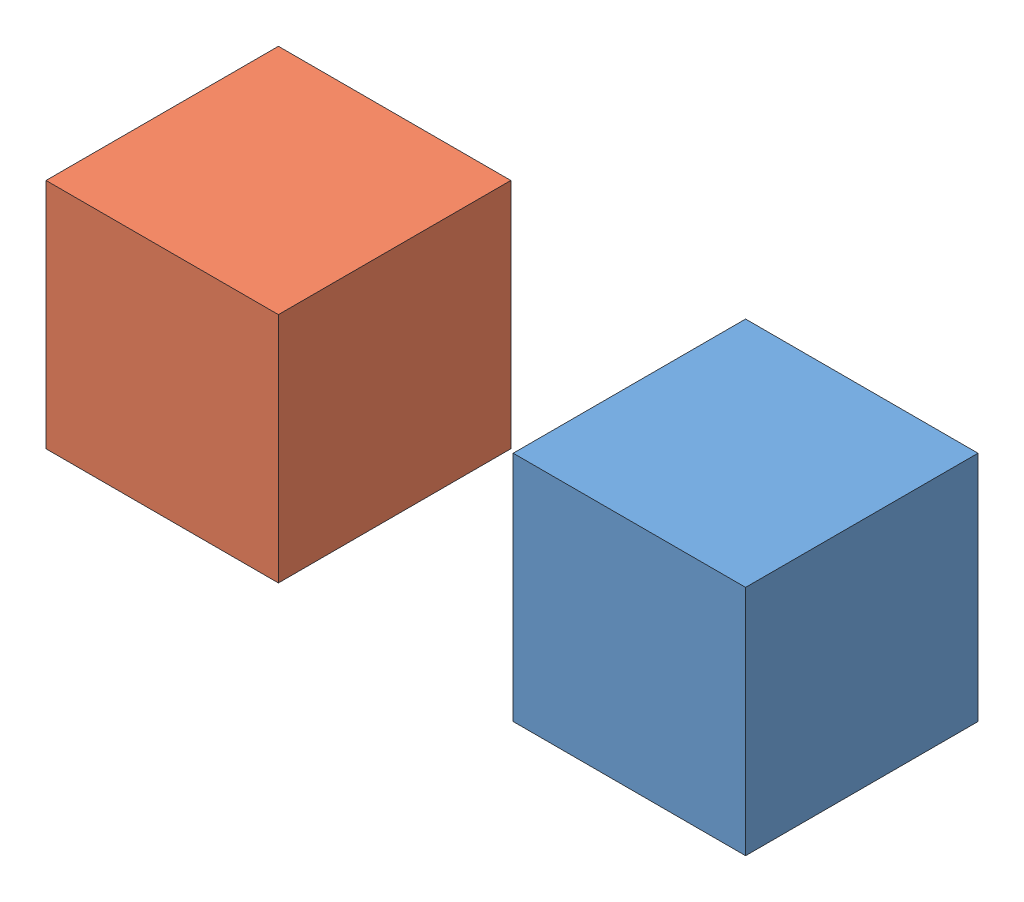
SolidWorks assembly Blank.SLDASM, configuration Default (file format 11000). Lengths in mm.
Overall size (120.8 120.49 119.81).
2 component instances, 2 part files, 0 mates.
Components (placement in the parent):
- Blank-1: Blank.SLDPRT [Default] at origin size (60 60 60)
- Blank1-1: Blank1.SLDPRT [Default] at (-60.8034 60.4864 59.8094) size (60 60 60)
